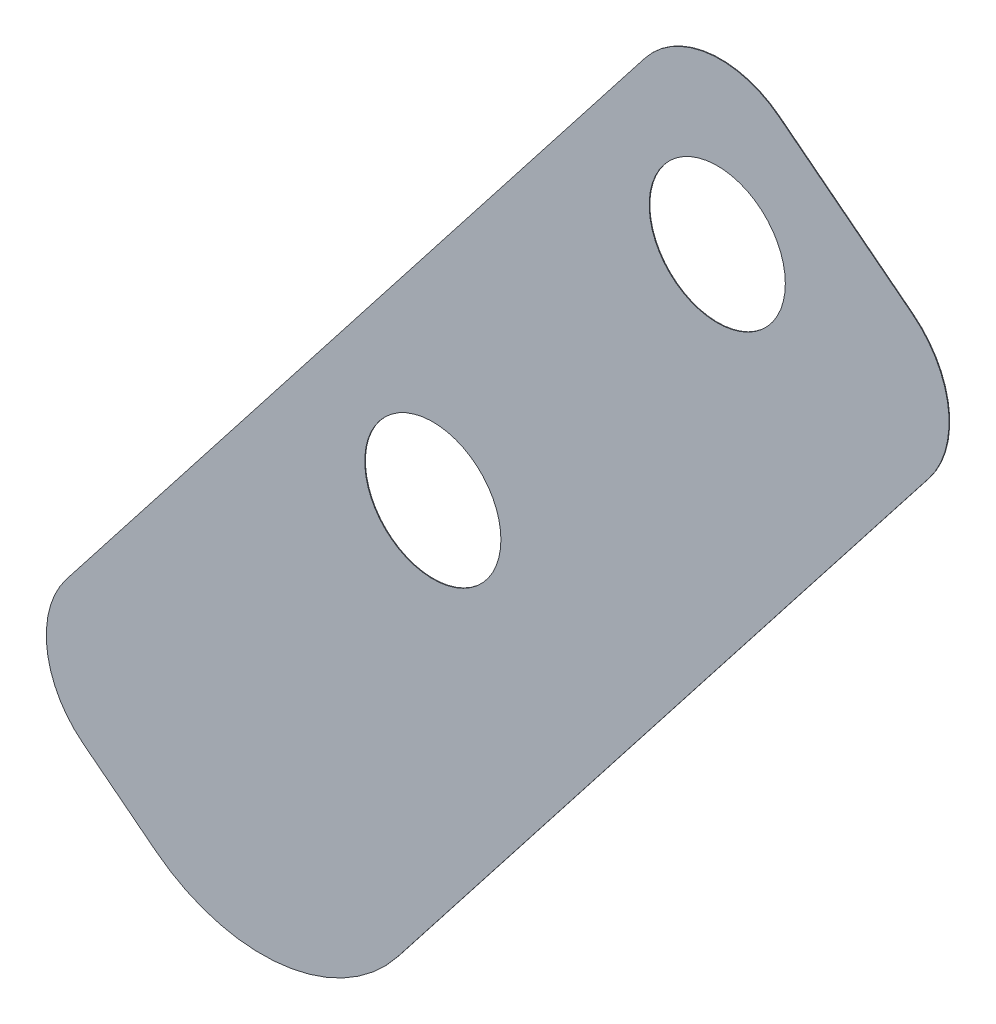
ISO-10303-21;
HEADER;
FILE_DESCRIPTION(('STEP AP214'),'2;1');
FILE_NAME('part.step','',(''),(''),'','','');
FILE_SCHEMA(('AUTOMOTIVE_DESIGN { 1 0 10303 214 1 1 1 1 }'));
ENDSEC;
DATA;
#1=APPLICATION_CONTEXT('core data for automotive mechanical design processes');
#2=APPLICATION_PROTOCOL_DEFINITION('international standard','automotive_design',2000,#1);
#3=PRODUCT_CONTEXT('',#1,'mechanical');
#4=PRODUCT('Part','Part','',(#3));
#5=PRODUCT_RELATED_PRODUCT_CATEGORY('part','',(#4));
#6=PRODUCT_DEFINITION_FORMATION('','',#4);
#7=PRODUCT_DEFINITION_CONTEXT('part definition',#1,'design');
#8=PRODUCT_DEFINITION('design','',#6,#7);
#9=PRODUCT_DEFINITION_SHAPE('','',#8);
#10=(LENGTH_UNIT() NAMED_UNIT(*) SI_UNIT(.MILLI.,.METRE.));
#11=(NAMED_UNIT(*) PLANE_ANGLE_UNIT() SI_UNIT($,.RADIAN.));
#12=(NAMED_UNIT(*) SI_UNIT($,.STERADIAN.) SOLID_ANGLE_UNIT());
#13=UNCERTAINTY_MEASURE_WITH_UNIT(LENGTH_MEASURE(1.E-05),#10,'distance_accuracy_value','');
#14=(GEOMETRIC_REPRESENTATION_CONTEXT(3) GLOBAL_UNCERTAINTY_ASSIGNED_CONTEXT((#13)) GLOBAL_UNIT_ASSIGNED_CONTEXT((#10,
#11,#12)) REPRESENTATION_CONTEXT('',''));
#15=CARTESIAN_POINT('',(0.,0.,0.));
#16=DIRECTION('',(0.,0.,1.));
#17=DIRECTION('',(1.,0.,0.));
#18=AXIS2_PLACEMENT_3D('',#15,#16,#17);
#19=CARTESIAN_POINT('',(-498.124429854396,-34.4676747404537,0.0254000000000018));
#20=DIRECTION('',(0.,0.,-1.));
#21=DIRECTION('',(-1.,0.,0.));
#22=AXIS2_PLACEMENT_3D('',#19,#20,#21);
#23=CYLINDRICAL_SURFACE('',#22,3.93700000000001);
#24=CARTESIAN_POINT('',(-498.124429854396,-34.4676747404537,0.));
#25=DIRECTION('',(0.,0.,1.));
#26=DIRECTION('',(1.,0.,0.));
#27=AXIS2_PLACEMENT_3D('',#24,#25,#26);
#28=CIRCLE('',#27,3.93700000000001);
#29=CARTESIAN_POINT('',(-495.700570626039,-31.3652764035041,0.));
#30=VERTEX_POINT('',#29);
#31=CARTESIAN_POINT('',(-501.226828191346,-32.0438155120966,0.));
#32=VERTEX_POINT('',#31);
#33=EDGE_CURVE('E147',#30,#32,#28,.T.);
#34=ORIENTED_EDGE('',*,*,#33,.T.);
#35=DIRECTION('',(0.,0.,-1.));
#36=VECTOR('',#35,1.);
#37=CARTESIAN_POINT('',(-501.226828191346,-32.0438155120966,0.0254000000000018));
#38=LINE('',#37,#36);
#39=CARTESIAN_POINT('',(-501.226828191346,-32.0438155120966,0.0254000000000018));
#40=VERTEX_POINT('',#39);
#41=EDGE_CURVE('E11',#40,#32,#38,.T.);
#42=ORIENTED_EDGE('',*,*,#41,.F.);
#43=CARTESIAN_POINT('',(-498.124429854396,-34.4676747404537,0.0254000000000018));
#44=DIRECTION('',(0.,0.,1.));
#45=DIRECTION('',(1.,0.,0.));
#46=AXIS2_PLACEMENT_3D('',#43,#44,#45);
#47=CIRCLE('',#46,3.93700000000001);
#48=CARTESIAN_POINT('',(-495.700570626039,-31.3652764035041,0.0254000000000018));
#49=VERTEX_POINT('',#48);
#50=EDGE_CURVE('E170',#49,#40,#47,.T.);
#51=ORIENTED_EDGE('',*,*,#50,.F.);
#52=DIRECTION('',(0.,0.,-1.));
#53=VECTOR('',#52,1.);
#54=CARTESIAN_POINT('',(-495.700570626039,-31.3652764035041,0.0254000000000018));
#55=LINE('',#54,#53);
#56=EDGE_CURVE('E143',#49,#30,#55,.T.);
#57=ORIENTED_EDGE('',*,*,#56,.T.);
#58=EDGE_LOOP('',(#34,#42,#51,#57));
#59=FACE_BOUND('',#58,.T.);
#60=ADVANCED_FACE('F45',(#59),#23,.T.);
#61=CARTESIAN_POINT('',(-501.226828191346,-32.0438155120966,0.0254000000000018));
#62=DIRECTION('',(0.788010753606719,-0.615661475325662,0.));
#63=DIRECTION('',(0.615661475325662,0.788010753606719,0.));
#64=AXIS2_PLACEMENT_3D('',#61,#62,#63);
#65=PLANE('',#64);
#66=DIRECTION('',(-0.615661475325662,-0.788010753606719,0.));
#67=VECTOR('',#66,1.);
#68=CARTESIAN_POINT('',(-501.226828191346,-32.0438155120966,0.));
#69=LINE('',#68,#67);
#70=CARTESIAN_POINT('',(-525.074475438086,-62.5674120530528,0.));
#71=VERTEX_POINT('',#70);
#72=EDGE_CURVE('E151',#32,#71,#69,.T.);
#73=ORIENTED_EDGE('',*,*,#72,.T.);
#74=DIRECTION('',(0.,0.,-1.));
#75=VECTOR('',#74,1.);
#76=CARTESIAN_POINT('',(-525.074475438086,-62.5674120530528,0.0254000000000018));
#77=LINE('',#76,#75);
#78=CARTESIAN_POINT('',(-525.074475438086,-62.5674120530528,0.0254000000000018));
#79=VERTEX_POINT('',#78);
#80=EDGE_CURVE('E54',#79,#71,#77,.T.);
#81=ORIENTED_EDGE('',*,*,#80,.F.);
#82=DIRECTION('',(-0.615661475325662,-0.788010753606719,0.));
#83=VECTOR('',#82,1.);
#84=CARTESIAN_POINT('',(-501.226828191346,-32.0438155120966,0.0254000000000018));
#85=LINE('',#84,#83);
#86=EDGE_CURVE('E105',#40,#79,#85,.T.);
#87=ORIENTED_EDGE('',*,*,#86,.F.);
#88=ORIENTED_EDGE('',*,*,#41,.T.);
#89=EDGE_LOOP('',(#73,#81,#87,#88));
#90=FACE_BOUND('',#89,.T.);
#91=ADVANCED_FACE('F257',(#90),#65,.F.);
#92=CARTESIAN_POINT('',(-521.972077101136,-64.99127128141,0.0254000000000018));
#93=DIRECTION('',(0.,0.,-1.));
#94=DIRECTION('',(-1.,0.,0.));
#95=AXIS2_PLACEMENT_3D('',#92,#93,#94);
#96=CYLINDRICAL_SURFACE('',#95,3.93700000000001);
#97=CARTESIAN_POINT('',(-521.972077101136,-64.99127128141,0.));
#98=DIRECTION('',(0.,0.,1.));
#99=DIRECTION('',(1.,0.,0.));
#100=AXIS2_PLACEMENT_3D('',#97,#98,#99);
#101=CIRCLE('',#100,3.93700000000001);
#102=CARTESIAN_POINT('',(-524.395936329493,-68.0936696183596,0.));
#103=VERTEX_POINT('',#102);
#104=EDGE_CURVE('E155',#71,#103,#101,.T.);
#105=ORIENTED_EDGE('',*,*,#104,.T.);
#106=DIRECTION('',(0.,0.,-1.));
#107=VECTOR('',#106,1.);
#108=CARTESIAN_POINT('',(-524.395936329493,-68.0936696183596,0.0254000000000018));
#109=LINE('',#108,#107);
#110=CARTESIAN_POINT('',(-524.395936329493,-68.0936696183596,0.0254000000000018));
#111=VERTEX_POINT('',#110);
#112=EDGE_CURVE('E181',#111,#103,#109,.T.);
#113=ORIENTED_EDGE('',*,*,#112,.F.);
#114=CARTESIAN_POINT('',(-521.972077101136,-64.99127128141,0.0254000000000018));
#115=DIRECTION('',(0.,0.,1.));
#116=DIRECTION('',(1.,0.,0.));
#117=AXIS2_PLACEMENT_3D('',#114,#115,#116);
#118=CIRCLE('',#117,3.93700000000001);
#119=EDGE_CURVE('E192',#79,#111,#118,.T.);
#120=ORIENTED_EDGE('',*,*,#119,.F.);
#121=ORIENTED_EDGE('',*,*,#80,.T.);
#122=EDGE_LOOP('',(#105,#113,#120,#121));
#123=FACE_BOUND('',#122,.T.);
#124=ADVANCED_FACE('F190',(#123),#96,.T.);
#125=CARTESIAN_POINT('',(-524.395936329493,-68.0936696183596,0.0254000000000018));
#126=DIRECTION('',(0.615661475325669,0.788010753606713,0.));
#127=DIRECTION('',(-0.788010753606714,0.615661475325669,0.));
#128=AXIS2_PLACEMENT_3D('',#125,#126,#127);
#129=PLANE('',#128);
#130=DIRECTION('',(0.788010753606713,-0.615661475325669,0.));
#131=VECTOR('',#130,1.);
#132=CARTESIAN_POINT('',(-524.395936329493,-68.0936696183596,0.));
#133=LINE('',#132,#131);
#134=CARTESIAN_POINT('',(-521.393615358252,-70.4393398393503,0.));
#135=VERTEX_POINT('',#134);
#136=EDGE_CURVE('E158',#103,#135,#133,.T.);
#137=ORIENTED_EDGE('',*,*,#136,.T.);
#138=DIRECTION('',(0.,0.,-1.));
#139=VECTOR('',#138,1.);
#140=CARTESIAN_POINT('',(-521.393615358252,-70.4393398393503,0.0254000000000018));
#141=LINE('',#140,#139);
#142=CARTESIAN_POINT('',(-521.393615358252,-70.4393398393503,0.0254000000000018));
#143=VERTEX_POINT('',#142);
#144=EDGE_CURVE('E177',#143,#135,#141,.T.);
#145=ORIENTED_EDGE('',*,*,#144,.F.);
#146=DIRECTION('',(0.788010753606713,-0.615661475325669,0.));
#147=VECTOR('',#146,1.);
#148=CARTESIAN_POINT('',(-524.395936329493,-68.0936696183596,0.0254000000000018));
#149=LINE('',#148,#147);
#150=EDGE_CURVE('E205',#111,#143,#149,.T.);
#151=ORIENTED_EDGE('',*,*,#150,.F.);
#152=ORIENTED_EDGE('',*,*,#112,.T.);
#153=EDGE_LOOP('',(#137,#145,#151,#152));
#154=FACE_BOUND('',#153,.T.);
#155=ADVANCED_FACE('F200',(#154),#129,.F.);
#156=CARTESIAN_POINT('',(-517.015030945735,-64.8350073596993,0.0254000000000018));
#157=DIRECTION('',(0.,0.,-1.));
#158=DIRECTION('',(-1.,0.,0.));
#159=AXIS2_PLACEMENT_3D('',#156,#157,#158);
#160=CYLINDRICAL_SURFACE('',#159,7.11200000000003);
#161=CARTESIAN_POINT('',(-517.015030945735,-64.8350073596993,0.));
#162=DIRECTION('',(0.,0.,1.));
#163=DIRECTION('',(1.,0.,0.));
#164=AXIS2_PLACEMENT_3D('',#161,#162,#163);
#165=CIRCLE('',#164,7.11200000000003);
#166=CARTESIAN_POINT('',(-511.410698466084,-69.2135917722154,0.));
#167=VERTEX_POINT('',#166);
#168=EDGE_CURVE('E161',#135,#167,#165,.T.);
#169=ORIENTED_EDGE('',*,*,#168,.T.);
#170=DIRECTION('',(0.,0.,-1.));
#171=VECTOR('',#170,1.);
#172=CARTESIAN_POINT('',(-511.410698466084,-69.2135917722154,0.0254000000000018));
#173=LINE('',#172,#171);
#174=CARTESIAN_POINT('',(-511.410698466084,-69.2135917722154,0.0254000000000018));
#175=VERTEX_POINT('',#174);
#176=EDGE_CURVE('E135',#175,#167,#173,.T.);
#177=ORIENTED_EDGE('',*,*,#176,.F.);
#178=CARTESIAN_POINT('',(-517.015030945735,-64.8350073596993,0.0254000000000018));
#179=DIRECTION('',(0.,0.,1.));
#180=DIRECTION('',(1.,0.,0.));
#181=AXIS2_PLACEMENT_3D('',#178,#179,#180);
#182=CIRCLE('',#181,7.11200000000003);
#183=EDGE_CURVE('E124',#143,#175,#182,.T.);
#184=ORIENTED_EDGE('',*,*,#183,.F.);
#185=ORIENTED_EDGE('',*,*,#144,.T.);
#186=EDGE_LOOP('',(#169,#177,#184,#185));
#187=FACE_BOUND('',#186,.T.);
#188=ADVANCED_FACE('F203',(#187),#160,.T.);
#189=CARTESIAN_POINT('',(-511.410698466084,-69.2135917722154,0.0254000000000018));
#190=DIRECTION('',(-0.78801075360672,0.615661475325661,0.));
#191=DIRECTION('',(-0.615661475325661,-0.78801075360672,0.));
#192=AXIS2_PLACEMENT_3D('',#189,#190,#191);
#193=PLANE('',#192);
#194=DIRECTION('',(0.615661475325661,0.78801075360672,0.));
#195=VECTOR('',#194,1.);
#196=CARTESIAN_POINT('',(-511.410698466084,-69.2135917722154,0.));
#197=LINE('',#196,#195);
#198=CARTESIAN_POINT('',(-489.517776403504,-41.1919293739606,0.));
#199=VERTEX_POINT('',#198);
#200=EDGE_CURVE('E133',#167,#199,#197,.T.);
#201=ORIENTED_EDGE('',*,*,#200,.T.);
#202=DIRECTION('',(0.,0.,-1.));
#203=VECTOR('',#202,1.);
#204=CARTESIAN_POINT('',(-489.517776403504,-41.1919293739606,0.0254000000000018));
#205=LINE('',#204,#203);
#206=CARTESIAN_POINT('',(-489.517776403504,-41.1919293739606,0.0254000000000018));
#207=VERTEX_POINT('',#206);
#208=EDGE_CURVE('E130',#207,#199,#205,.T.);
#209=ORIENTED_EDGE('',*,*,#208,.F.);
#210=DIRECTION('',(0.615661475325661,0.78801075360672,0.));
#211=VECTOR('',#210,1.);
#212=CARTESIAN_POINT('',(-511.410698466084,-69.2135917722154,0.0254000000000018));
#213=LINE('',#212,#211);
#214=EDGE_CURVE('E118',#175,#207,#213,.T.);
#215=ORIENTED_EDGE('',*,*,#214,.F.);
#216=ORIENTED_EDGE('',*,*,#176,.T.);
#217=EDGE_LOOP('',(#201,#209,#215,#216));
#218=FACE_BOUND('',#217,.T.);
#219=ADVANCED_FACE('F131',(#218),#193,.F.);
#220=CARTESIAN_POINT('',(-492.620174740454,-38.7680701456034,0.0254000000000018));
#221=DIRECTION('',(0.,0.,-1.));
#222=DIRECTION('',(-1.,0.,0.));
#223=AXIS2_PLACEMENT_3D('',#220,#221,#222);
#224=CYLINDRICAL_SURFACE('',#223,3.93699999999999);
#225=CARTESIAN_POINT('',(-492.620174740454,-38.7680701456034,0.));
#226=DIRECTION('',(0.,0.,1.));
#227=DIRECTION('',(1.,0.,0.));
#228=AXIS2_PLACEMENT_3D('',#225,#226,#227);
#229=CIRCLE('',#228,3.93699999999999);
#230=CARTESIAN_POINT('',(-490.196315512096,-35.6656718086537,0.));
#231=VERTEX_POINT('',#230);
#232=EDGE_CURVE('E91',#199,#231,#229,.T.);
#233=ORIENTED_EDGE('',*,*,#232,.T.);
#234=DIRECTION('',(0.,0.,-1.));
#235=VECTOR('',#234,1.);
#236=CARTESIAN_POINT('',(-490.196315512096,-35.6656718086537,0.0254000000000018));
#237=LINE('',#236,#235);
#238=CARTESIAN_POINT('',(-490.196315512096,-35.6656718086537,0.0254000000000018));
#239=VERTEX_POINT('',#238);
#240=EDGE_CURVE('E136',#239,#231,#237,.T.);
#241=ORIENTED_EDGE('',*,*,#240,.F.);
#242=CARTESIAN_POINT('',(-492.620174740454,-38.7680701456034,0.0254000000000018));
#243=DIRECTION('',(0.,0.,1.));
#244=DIRECTION('',(1.,0.,0.));
#245=AXIS2_PLACEMENT_3D('',#242,#243,#244);
#246=CIRCLE('',#245,3.93699999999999);
#247=EDGE_CURVE('E122',#207,#239,#246,.T.);
#248=ORIENTED_EDGE('',*,*,#247,.F.);
#249=ORIENTED_EDGE('',*,*,#208,.T.);
#250=EDGE_LOOP('',(#233,#241,#248,#249));
#251=FACE_BOUND('',#250,.T.);
#252=ADVANCED_FACE('F138',(#251),#224,.T.);
#253=CARTESIAN_POINT('',(-490.196315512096,-35.6656718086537,0.0254000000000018));
#254=DIRECTION('',(-0.615661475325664,-0.788010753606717,0.));
#255=DIRECTION('',(0.788010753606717,-0.615661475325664,0.));
#256=AXIS2_PLACEMENT_3D('',#253,#254,#255);
#257=PLANE('',#256);
#258=DIRECTION('',(-0.788010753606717,0.615661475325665,0.));
#259=VECTOR('',#258,1.);
#260=CARTESIAN_POINT('',(-490.196315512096,-35.6656718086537,0.));
#261=LINE('',#260,#259);
#262=EDGE_CURVE('E97',#231,#30,#261,.T.);
#263=ORIENTED_EDGE('',*,*,#262,.T.);
#264=ORIENTED_EDGE('',*,*,#56,.F.);
#265=DIRECTION('',(-0.788010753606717,0.615661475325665,0.));
#266=VECTOR('',#265,1.);
#267=CARTESIAN_POINT('',(-490.196315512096,-35.6656718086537,0.0254000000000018));
#268=LINE('',#267,#266);
#269=EDGE_CURVE('E62',#239,#49,#268,.T.);
#270=ORIENTED_EDGE('',*,*,#269,.F.);
#271=ORIENTED_EDGE('',*,*,#240,.T.);
#272=EDGE_LOOP('',(#263,#264,#270,#271));
#273=FACE_BOUND('',#272,.T.);
#274=ADVANCED_FACE('F244',(#273),#257,.F.);
#275=CARTESIAN_POINT('',(-498.124429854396,-34.4676747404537,0.0254000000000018));
#276=DIRECTION('',(0.,0.,1.));
#277=DIRECTION('',(1.,0.,0.));
#278=AXIS2_PLACEMENT_3D('',#275,#276,#277);
#279=PLANE('',#278);
#280=CARTESIAN_POINT('',(-498.241770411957,-37.1963912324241,0.0254000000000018));
#281=DIRECTION('',(0.,0.,1.));
#282=DIRECTION('',(1.,0.,0.));
#283=AXIS2_PLACEMENT_3D('',#280,#281,#282);
#284=CIRCLE('',#283,2.8067);
#285=CARTESIAN_POINT('',(-495.435070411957,-37.1963912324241,0.0254000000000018));
#286=VERTEX_POINT('',#285);
#287=EDGE_CURVE('E223',#286,#286,#284,.T.);
#288=ORIENTED_EDGE('',*,*,#287,.F.);
#289=EDGE_LOOP('',(#288));
#290=FACE_BOUND('',#289,.T.);
#291=CARTESIAN_POINT('',(-509.970121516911,-52.2079960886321,0.0254000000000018));
#292=DIRECTION('',(0.,0.,1.));
#293=DIRECTION('',(1.,0.,0.));
#294=AXIS2_PLACEMENT_3D('',#291,#292,#293);
#295=CIRCLE('',#294,2.80670000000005);
#296=CARTESIAN_POINT('',(-507.163421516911,-52.2079960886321,0.0254000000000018));
#297=VERTEX_POINT('',#296);
#298=EDGE_CURVE('E152',#297,#297,#295,.T.);
#299=ORIENTED_EDGE('',*,*,#298,.F.);
#300=EDGE_LOOP('',(#299));
#301=FACE_BOUND('',#300,.T.);
#302=ORIENTED_EDGE('',*,*,#50,.T.);
#303=ORIENTED_EDGE('',*,*,#86,.T.);
#304=ORIENTED_EDGE('',*,*,#119,.T.);
#305=ORIENTED_EDGE('',*,*,#150,.T.);
#306=ORIENTED_EDGE('',*,*,#183,.T.);
#307=ORIENTED_EDGE('',*,*,#214,.T.);
#308=ORIENTED_EDGE('',*,*,#247,.T.);
#309=ORIENTED_EDGE('',*,*,#269,.T.);
#310=EDGE_LOOP('',(#302,#303,#304,#305,#306,#307,#308,#309));
#311=FACE_BOUND('',#310,.T.);
#312=ADVANCED_FACE('F120',(#290,#301,#311),#279,.T.);
#313=CARTESIAN_POINT('',(-498.124429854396,-34.4676747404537,0.));
#314=DIRECTION('',(0.,0.,1.));
#315=DIRECTION('',(1.,0.,0.));
#316=AXIS2_PLACEMENT_3D('',#313,#314,#315);
#317=PLANE('',#316);
#318=CARTESIAN_POINT('',(-498.241770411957,-37.1963912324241,0.));
#319=DIRECTION('',(0.,0.,1.));
#320=DIRECTION('',(1.,0.,0.));
#321=AXIS2_PLACEMENT_3D('',#318,#319,#320);
#322=CIRCLE('',#321,2.8067);
#323=CARTESIAN_POINT('',(-495.435070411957,-37.1963912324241,0.));
#324=VERTEX_POINT('',#323);
#325=EDGE_CURVE('E227',#324,#324,#322,.T.);
#326=ORIENTED_EDGE('',*,*,#325,.T.);
#327=EDGE_LOOP('',(#326));
#328=FACE_BOUND('',#327,.T.);
#329=CARTESIAN_POINT('',(-509.970121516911,-52.2079960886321,0.));
#330=DIRECTION('',(0.,0.,1.));
#331=DIRECTION('',(1.,0.,0.));
#332=AXIS2_PLACEMENT_3D('',#329,#330,#331);
#333=CIRCLE('',#332,2.80670000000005);
#334=CARTESIAN_POINT('',(-507.163421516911,-52.2079960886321,0.));
#335=VERTEX_POINT('',#334);
#336=EDGE_CURVE('E219',#335,#335,#333,.T.);
#337=ORIENTED_EDGE('',*,*,#336,.T.);
#338=EDGE_LOOP('',(#337));
#339=FACE_BOUND('',#338,.T.);
#340=ORIENTED_EDGE('',*,*,#33,.F.);
#341=ORIENTED_EDGE('',*,*,#262,.F.);
#342=ORIENTED_EDGE('',*,*,#232,.F.);
#343=ORIENTED_EDGE('',*,*,#200,.F.);
#344=ORIENTED_EDGE('',*,*,#168,.F.);
#345=ORIENTED_EDGE('',*,*,#136,.F.);
#346=ORIENTED_EDGE('',*,*,#104,.F.);
#347=ORIENTED_EDGE('',*,*,#72,.F.);
#348=EDGE_LOOP('',(#340,#341,#342,#343,#344,#345,#346,#347));
#349=FACE_BOUND('',#348,.T.);
#350=ADVANCED_FACE('F196',(#328,#339,#349),#317,.F.);
#351=CARTESIAN_POINT('',(-509.970121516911,-52.2079960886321,0.0254000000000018));
#352=DIRECTION('',(0.,0.,1.));
#353=DIRECTION('',(1.,0.,0.));
#354=AXIS2_PLACEMENT_3D('',#351,#352,#353);
#355=CYLINDRICAL_SURFACE('',#354,2.80670000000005);
#356=ORIENTED_EDGE('',*,*,#336,.F.);
#357=EDGE_LOOP('',(#356));
#358=FACE_BOUND('',#357,.T.);
#359=ORIENTED_EDGE('',*,*,#298,.T.);
#360=EDGE_LOOP('',(#359));
#361=FACE_BOUND('',#360,.T.);
#362=ADVANCED_FACE('F238',(#358,#361),#355,.F.);
#363=CARTESIAN_POINT('',(-498.241770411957,-37.1963912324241,0.0254000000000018));
#364=DIRECTION('',(0.,0.,1.));
#365=DIRECTION('',(1.,0.,0.));
#366=AXIS2_PLACEMENT_3D('',#363,#364,#365);
#367=CYLINDRICAL_SURFACE('',#366,2.8067);
#368=ORIENTED_EDGE('',*,*,#325,.F.);
#369=EDGE_LOOP('',(#368));
#370=FACE_BOUND('',#369,.T.);
#371=ORIENTED_EDGE('',*,*,#287,.T.);
#372=EDGE_LOOP('',(#371));
#373=FACE_BOUND('',#372,.T.);
#374=ADVANCED_FACE('F235',(#370,#373),#367,.F.);
#375=CLOSED_SHELL('',(#60,#91,#124,#155,#188,#219,#252,#274,#312,#350,#362,#374));
#376=MANIFOLD_SOLID_BREP('B2',#375);
#377=ADVANCED_BREP_SHAPE_REPRESENTATION('',(#18,#376),#14);
#378=SHAPE_DEFINITION_REPRESENTATION(#9,#377);
ENDSEC;
END-ISO-10303-21;
